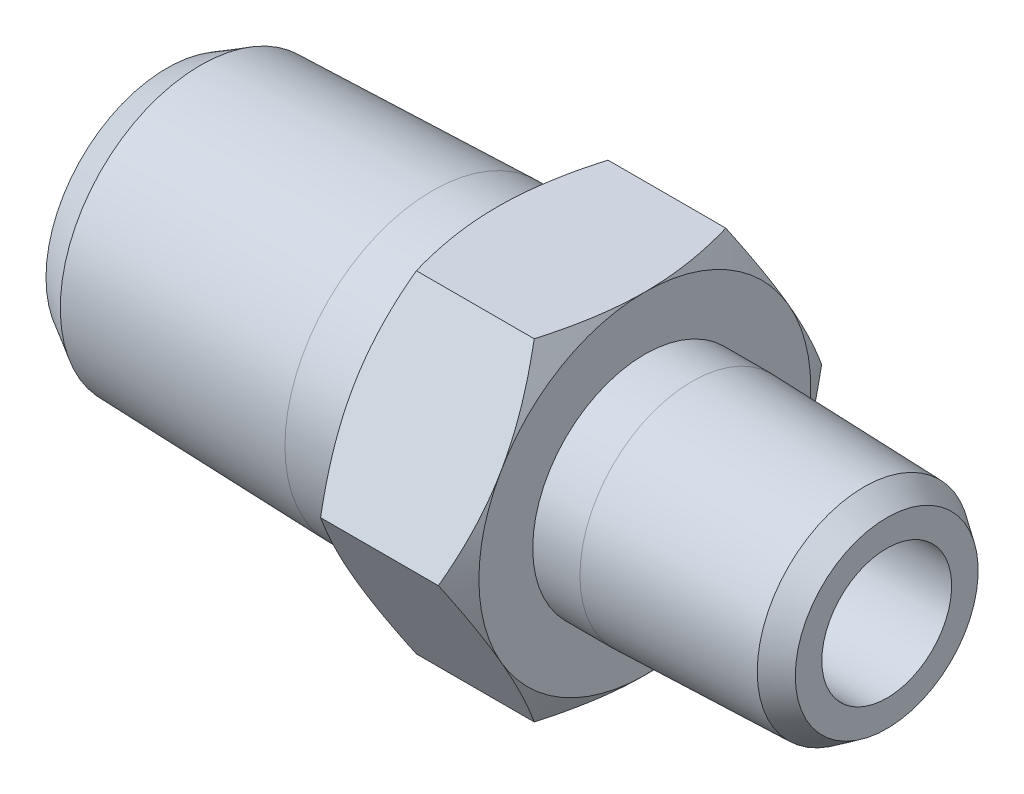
ISO-10303-21;
HEADER;
FILE_DESCRIPTION(('STEP AP214'),'2;1');
FILE_NAME('part.step','',(''),(''),'','','');
FILE_SCHEMA(('AUTOMOTIVE_DESIGN { 1 0 10303 214 1 1 1 1 }'));
ENDSEC;
DATA;
#1=APPLICATION_CONTEXT('core data for automotive mechanical design processes');
#2=APPLICATION_PROTOCOL_DEFINITION('international standard','automotive_design',2000,#1);
#3=PRODUCT_CONTEXT('',#1,'mechanical');
#4=PRODUCT('Part','Part','',(#3));
#5=PRODUCT_RELATED_PRODUCT_CATEGORY('part','',(#4));
#6=PRODUCT_DEFINITION_FORMATION('','',#4);
#7=PRODUCT_DEFINITION_CONTEXT('part definition',#1,'design');
#8=PRODUCT_DEFINITION('design','',#6,#7);
#9=PRODUCT_DEFINITION_SHAPE('','',#8);
#10=(LENGTH_UNIT() NAMED_UNIT(*) SI_UNIT(.MILLI.,.METRE.));
#11=(NAMED_UNIT(*) PLANE_ANGLE_UNIT() SI_UNIT($,.RADIAN.));
#12=(NAMED_UNIT(*) SI_UNIT($,.STERADIAN.) SOLID_ANGLE_UNIT());
#13=UNCERTAINTY_MEASURE_WITH_UNIT(LENGTH_MEASURE(1.E-05),#10,'distance_accuracy_value','');
#14=(GEOMETRIC_REPRESENTATION_CONTEXT(3) GLOBAL_UNCERTAINTY_ASSIGNED_CONTEXT((#13)) GLOBAL_UNIT_ASSIGNED_CONTEXT((#10,
#11,#12)) REPRESENTATION_CONTEXT('',''));
#15=CARTESIAN_POINT('',(0.,0.,0.));
#16=DIRECTION('',(0.,0.,1.));
#17=DIRECTION('',(1.,0.,0.));
#18=AXIS2_PLACEMENT_3D('',#15,#16,#17);
#19=CARTESIAN_POINT('',(8.38200000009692,0.,0.));
#20=DIRECTION('',(-1.,0.,0.));
#21=DIRECTION('',(0.,0.,1.));
#22=AXIS2_PLACEMENT_3D('',#19,#20,#21);
#23=CONICAL_SURFACE('',#22,4.82599999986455,0.0311192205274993);
#24=CARTESIAN_POINT('',(8.382,0.,0.));
#25=DIRECTION('',(1.,0.,0.));
#26=DIRECTION('',(0.,1.,0.));
#27=AXIS2_PLACEMENT_3D('',#24,#25,#26);
#28=CIRCLE('',#27,4.826);
#29=CARTESIAN_POINT('',(8.382,4.826,0.));
#30=VERTEX_POINT('',#29);
#31=EDGE_CURVE('E398',#30,#30,#28,.F.);
#32=ORIENTED_EDGE('',*,*,#31,.F.);
#33=EDGE_LOOP('',(#32));
#34=FACE_BOUND('',#33,.T.);
#35=CARTESIAN_POINT('',(15.7849748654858,0.,0.));
#36=DIRECTION('',(1.,0.,0.));
#37=DIRECTION('',(0.,0.,-1.));
#38=AXIS2_PLACEMENT_3D('',#35,#36,#37);
#39=CIRCLE('',#38,4.59555079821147);
#40=CARTESIAN_POINT('',(15.7849748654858,0.,-4.59555079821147));
#41=VERTEX_POINT('',#40);
#42=EDGE_CURVE('E20',#41,#41,#39,.T.);
#43=ORIENTED_EDGE('',*,*,#42,.F.);
#44=EDGE_LOOP('',(#43));
#45=FACE_BOUND('',#44,.T.);
#46=ADVANCED_FACE('F16',(#34,#45),#23,.T.);
#47=CARTESIAN_POINT('',(15.7479999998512,0.,0.));
#48=DIRECTION('',(-1.,0.,0.));
#49=DIRECTION('',(0.,0.,1.));
#50=AXIS2_PLACEMENT_3D('',#47,#48,#49);
#51=CONICAL_SURFACE('',#50,4.62042230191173,0.59214018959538);
#52=CARTESIAN_POINT('',(16.7640000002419,0.,0.));
#53=DIRECTION('',(-1.,0.,0.));
#54=DIRECTION('',(0.,0.,1.));
#55=AXIS2_PLACEMENT_3D('',#52,#53,#54);
#56=CIRCLE('',#55,3.93700000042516);
#57=CARTESIAN_POINT('',(16.7640000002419,0.,3.93700000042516));
#58=VERTEX_POINT('',#57);
#59=EDGE_CURVE('E400',#58,#58,#56,.F.);
#60=ORIENTED_EDGE('',*,*,#59,.F.);
#61=EDGE_LOOP('',(#60));
#62=FACE_BOUND('',#61,.T.);
#63=ORIENTED_EDGE('',*,*,#42,.T.);
#64=EDGE_LOOP('',(#63));
#65=FACE_BOUND('',#64,.T.);
#66=ADVANCED_FACE('F18',(#62,#65),#51,.T.);
#67=CARTESIAN_POINT('',(7.366,0.,0.));
#68=DIRECTION('',(1.,0.,0.));
#69=DIRECTION('',(0.,1.,0.));
#70=AXIS2_PLACEMENT_3D('',#67,#68,#69);
#71=CYLINDRICAL_SURFACE('',#70,4.826);
#72=CARTESIAN_POINT('',(6.35,0.,0.));
#73=DIRECTION('',(1.,0.,0.));
#74=DIRECTION('',(0.,1.,0.));
#75=AXIS2_PLACEMENT_3D('',#72,#73,#74);
#76=CIRCLE('',#75,4.826);
#77=CARTESIAN_POINT('',(6.35,4.826,0.));
#78=VERTEX_POINT('',#77);
#79=EDGE_CURVE('E421',#78,#78,#76,.F.);
#80=ORIENTED_EDGE('',*,*,#79,.F.);
#81=EDGE_LOOP('',(#80));
#82=FACE_BOUND('',#81,.T.);
#83=ORIENTED_EDGE('',*,*,#31,.T.);
#84=EDGE_LOOP('',(#83));
#85=FACE_BOUND('',#84,.T.);
#86=ADVANCED_FACE('F483',(#82,#85),#71,.T.);
#87=CARTESIAN_POINT('',(16.764,2.29439748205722,0.));
#88=DIRECTION('',(1.,0.,0.));
#89=DIRECTION('',(0.,0.,-1.));
#90=AXIS2_PLACEMENT_3D('',#87,#88,#89);
#91=PLANE('',#90);
#92=CARTESIAN_POINT('',(16.764,0.,0.));
#93=DIRECTION('',(-1.,0.,0.));
#94=DIRECTION('',(0.,0.,1.));
#95=AXIS2_PLACEMENT_3D('',#92,#93,#94);
#96=CIRCLE('',#95,2.794);
#97=CARTESIAN_POINT('',(16.764,0.,2.794));
#98=VERTEX_POINT('',#97);
#99=EDGE_CURVE('E127',#98,#98,#96,.T.);
#100=ORIENTED_EDGE('',*,*,#99,.T.);
#101=EDGE_LOOP('',(#100));
#102=FACE_BOUND('',#101,.T.);
#103=ORIENTED_EDGE('',*,*,#59,.T.);
#104=EDGE_LOOP('',(#103));
#105=FACE_BOUND('',#104,.T.);
#106=ADVANCED_FACE('F428',(#102,#105),#91,.T.);
#107=CARTESIAN_POINT('',(6.35,0.,0.));
#108=DIRECTION('',(1.,0.,0.));
#109=DIRECTION('',(0.,0.,-1.));
#110=AXIS2_PLACEMENT_3D('',#107,#108,#109);
#111=PLANE('',#110);
#112=ORIENTED_EDGE('',*,*,#79,.T.);
#113=EDGE_LOOP('',(#112));
#114=FACE_BOUND('',#113,.T.);
#115=CARTESIAN_POINT('',(6.35000000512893,0.,0.));
#116=DIRECTION('',(-1.,0.,0.));
#117=DIRECTION('',(0.,0.,1.));
#118=AXIS2_PLACEMENT_3D('',#115,#116,#117);
#119=CIRCLE('',#118,7.14375000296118);
#120=CARTESIAN_POINT('',(6.35000000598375,-3.57187500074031,6.18666897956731));
#121=VERTEX_POINT('',#120);
#122=CARTESIAN_POINT('',(6.35000000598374,3.5718750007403,6.18666897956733));
#123=VERTEX_POINT('',#122);
#124=EDGE_CURVE('E413',#121,#123,#119,.T.);
#125=ORIENTED_EDGE('',*,*,#124,.F.);
#126=CARTESIAN_POINT('',(6.35000000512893,0.,0.));
#127=DIRECTION('',(-1.,0.,0.));
#128=DIRECTION('',(0.,0.,1.));
#129=AXIS2_PLACEMENT_3D('',#126,#127,#128);
#130=CIRCLE('',#129,7.14375000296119);
#131=CARTESIAN_POINT('',(6.35000000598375,-7.14375000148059,0.));
#132=VERTEX_POINT('',#131);
#133=EDGE_CURVE('E109',#132,#121,#130,.T.);
#134=ORIENTED_EDGE('',*,*,#133,.F.);
#135=CARTESIAN_POINT('',(6.35000000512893,0.,0.));
#136=DIRECTION('',(-1.,0.,0.));
#137=DIRECTION('',(0.,0.,1.));
#138=AXIS2_PLACEMENT_3D('',#135,#136,#137);
#139=CIRCLE('',#138,7.14375000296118);
#140=CARTESIAN_POINT('',(6.35000000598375,-3.5718750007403,-6.18666897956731));
#141=VERTEX_POINT('',#140);
#142=EDGE_CURVE('E106',#141,#132,#139,.T.);
#143=ORIENTED_EDGE('',*,*,#142,.F.);
#144=CARTESIAN_POINT('',(6.35000000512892,0.,0.));
#145=DIRECTION('',(-1.,0.,0.));
#146=DIRECTION('',(0.,0.,1.));
#147=AXIS2_PLACEMENT_3D('',#144,#145,#146);
#148=CIRCLE('',#147,7.1437500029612);
#149=CARTESIAN_POINT('',(6.35000000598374,3.57187500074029,-6.18666897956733));
#150=VERTEX_POINT('',#149);
#151=EDGE_CURVE('E103',#150,#141,#148,.T.);
#152=ORIENTED_EDGE('',*,*,#151,.F.);
#153=CARTESIAN_POINT('',(6.35000000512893,0.,0.));
#154=DIRECTION('',(-1.,0.,0.));
#155=DIRECTION('',(0.,0.,1.));
#156=AXIS2_PLACEMENT_3D('',#153,#154,#155);
#157=CIRCLE('',#156,7.14375000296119);
#158=CARTESIAN_POINT('',(6.35000000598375,7.14375000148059,0.));
#159=VERTEX_POINT('',#158);
#160=EDGE_CURVE('E126',#159,#150,#157,.T.);
#161=ORIENTED_EDGE('',*,*,#160,.F.);
#162=CARTESIAN_POINT('',(6.35000000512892,0.,0.));
#163=DIRECTION('',(-1.,0.,0.));
#164=DIRECTION('',(0.,0.,1.));
#165=AXIS2_PLACEMENT_3D('',#162,#163,#164);
#166=CIRCLE('',#165,7.1437500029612);
#167=EDGE_CURVE('E415',#123,#159,#166,.T.);
#168=ORIENTED_EDGE('',*,*,#167,.F.);
#169=EDGE_LOOP('',(#125,#134,#143,#152,#161,#168));
#170=FACE_BOUND('',#169,.T.);
#171=ADVANCED_FACE('F107',(#114,#170),#111,.T.);
#172=CARTESIAN_POINT('',(16.002,0.,0.));
#173=DIRECTION('',(-1.,0.,0.));
#174=DIRECTION('',(0.,0.,1.));
#175=AXIS2_PLACEMENT_3D('',#172,#173,#174);
#176=CYLINDRICAL_SURFACE('',#175,2.794);
#177=ORIENTED_EDGE('',*,*,#99,.F.);
#178=EDGE_LOOP('',(#177));
#179=FACE_BOUND('',#178,.T.);
#180=CARTESIAN_POINT('',(3.45243928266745,0.,0.));
#181=DIRECTION('',(-1.,0.,0.));
#182=DIRECTION('',(0.,0.,1.));
#183=AXIS2_PLACEMENT_3D('',#180,#181,#182);
#184=CIRCLE('',#183,2.794);
#185=CARTESIAN_POINT('',(3.45243928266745,0.,2.794));
#186=VERTEX_POINT('',#185);
#187=EDGE_CURVE('E115',#186,#186,#184,.T.);
#188=ORIENTED_EDGE('',*,*,#187,.T.);
#189=EDGE_LOOP('',(#188));
#190=FACE_BOUND('',#189,.T.);
#191=ADVANCED_FACE('F160',(#179,#190),#176,.F.);
#192=CARTESIAN_POINT('',(5.7081176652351,0.,0.));
#193=DIRECTION('',(-1.,0.,0.));
#194=DIRECTION('',(0.,0.,1.));
#195=AXIS2_PLACEMENT_3D('',#192,#193,#194);
#196=CONICAL_SURFACE('',#195,8.25552282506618,1.04719755);
#197=ORIENTED_EDGE('',*,*,#151,.T.);
#198=CARTESIAN_POINT('',(5.71194598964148,1.49851707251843E-09,-8.24889197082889));
#199=CARTESIAN_POINT('',(5.80888667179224,-0.290749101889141,-8.08102789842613));
#200=CARTESIAN_POINT('',(5.89770126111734,-0.583826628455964,-7.91181950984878));
#201=CARTESIAN_POINT('',(6.05432419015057,-1.17256513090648,-7.57191117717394));
#202=CARTESIAN_POINT('',(6.12223640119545,-1.46820557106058,-7.40122308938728));
#203=CARTESIAN_POINT('',(6.20562106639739,-1.91445635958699,-7.14358007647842));
#204=CARTESIAN_POINT('',(6.23034546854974,-2.06377033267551,-7.05737361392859));
#205=CARTESIAN_POINT('',(6.27314392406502,-2.36311310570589,-6.88454798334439));
#206=CARTESIAN_POINT('',(6.29121815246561,-2.51314188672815,-6.79792882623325));
#207=CARTESIAN_POINT('',(6.32039869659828,-2.81446921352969,-6.6239574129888));
#208=CARTESIAN_POINT('',(6.33146957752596,-2.96577035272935,-6.53660365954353));
#209=CARTESIAN_POINT('',(6.34628555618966,-3.26867019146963,-6.36172435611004));
#210=CARTESIAN_POINT('',(6.35002920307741,-3.42026894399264,-6.27419877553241));
#211=CARTESIAN_POINT('',(6.35000000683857,-3.57187499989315,-6.18666897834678));
#212=B_SPLINE_CURVE_WITH_KNOTS('',3,(#198,#199,#200,#201,#202,#203,#204,#205,#206,#207,#208,
#209,#210,#211),.UNSPECIFIED.,.F.,.F.,(4,2,2,2,2,2,4),(0.,1.04875487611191,2.09221068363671,
2.61462320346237,3.13702197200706,3.66204321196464,4.18716839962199),.UNSPECIFIED.);
#213=CARTESIAN_POINT('',(5.71194599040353,5.85629918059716E-10,-8.2488919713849));
#214=VERTEX_POINT('',#213);
#215=EDGE_CURVE('E121',#214,#141,#212,.T.);
#216=ORIENTED_EDGE('',*,*,#215,.F.);
#217=CARTESIAN_POINT('',(6.35000000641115,3.57187499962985,-6.18666897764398));
#218=CARTESIAN_POINT('',(6.35002920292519,3.42026894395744,-6.2741987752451));
#219=CARTESIAN_POINT('',(6.3462855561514,3.26867019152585,-6.36172435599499));
#220=CARTESIAN_POINT('',(6.33146957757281,2.96577035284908,-6.53660365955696));
#221=CARTESIAN_POINT('',(6.32039869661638,2.81446921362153,-6.62395741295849));
#222=CARTESIAN_POINT('',(6.29121815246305,2.51314188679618,-6.79792882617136));
#223=CARTESIAN_POINT('',(6.27314392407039,2.36311310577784,-6.88454798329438));
#224=CARTESIAN_POINT('',(6.23034546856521,2.06377033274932,-7.05737361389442));
#225=CARTESIAN_POINT('',(6.20562106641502,1.91445635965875,-7.1435800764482));
#226=CARTESIAN_POINT('',(6.12223640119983,1.46820557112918,-7.40122308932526));
#227=CARTESIAN_POINT('',(6.05432419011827,1.17256513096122,-7.57191117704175));
#228=CARTESIAN_POINT('',(5.89770126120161,0.583826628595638,-7.91181950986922));
#229=CARTESIAN_POINT('',(5.80888667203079,0.290749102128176,-8.08102789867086));
#230=CARTESIAN_POINT('',(5.71194599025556,-1.02951186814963E-09,-8.24889197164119));
#231=B_SPLINE_CURVE_WITH_KNOTS('',3,(#217,#218,#219,#220,#221,#222,#223,#224,#225,#226,#227,
#228,#229,#230),.UNSPECIFIED.,.F.,.F.,(4,2,2,2,2,2,4),(0.,0.525125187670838,1.05014642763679,
1.57254519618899,2.09495771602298,3.13841352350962,4.18716839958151),.UNSPECIFIED.);
#232=EDGE_CURVE('E124',#150,#214,#231,.T.);
#233=ORIENTED_EDGE('',*,*,#232,.F.);
#234=EDGE_LOOP('',(#197,#216,#233));
#235=FACE_BOUND('',#234,.T.);
#236=ADVANCED_FACE('F119',(#235),#196,.T.);
#237=CARTESIAN_POINT('',(5.7081176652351,0.,0.));
#238=DIRECTION('',(-1.,0.,0.));
#239=DIRECTION('',(0.,0.,1.));
#240=AXIS2_PLACEMENT_3D('',#237,#238,#239);
#241=CONICAL_SURFACE('',#240,8.25552282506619,1.04719755);
#242=ORIENTED_EDGE('',*,*,#160,.T.);
#243=CARTESIAN_POINT('',(5.71194598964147,7.14375000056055,-4.12444598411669));
#244=CARTESIAN_POINT('',(5.80888667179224,6.85300089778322,-4.29231005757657));
#245=CARTESIAN_POINT('',(5.89770126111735,6.5599233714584,-4.46151844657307));
#246=CARTESIAN_POINT('',(6.05432419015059,5.97118486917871,-4.80142677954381));
#247=CARTESIAN_POINT('',(6.12223640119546,5.67554442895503,-4.97211486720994));
#248=CARTESIAN_POINT('',(6.2056210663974,5.22929364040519,-5.22975788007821));
#249=CARTESIAN_POINT('',(6.23034546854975,5.07997966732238,-5.31596434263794));
#250=CARTESIAN_POINT('',(6.27314392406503,4.78063689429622,-5.48878997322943));
#251=CARTESIAN_POINT('',(6.29121815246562,4.63060811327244,-5.57540913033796));
#252=CARTESIAN_POINT('',(6.3203986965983,4.3292807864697,-5.74938054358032));
#253=CARTESIAN_POINT('',(6.33146957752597,4.17797964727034,-5.83673429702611));
#254=CARTESIAN_POINT('',(6.34628555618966,3.87507980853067,-6.01161360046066));
#255=CARTESIAN_POINT('',(6.35002920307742,3.72348105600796,-6.09913918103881));
#256=CARTESIAN_POINT('',(6.35000000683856,3.57187500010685,-6.18666897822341));
#257=B_SPLINE_CURVE_WITH_KNOTS('',3,(#243,#244,#245,#246,#247,#248,#249,#250,#251,#252,#253,
#254,#255,#256),.UNSPECIFIED.,.F.,.F.,(4,2,2,2,2,2,4),(0.,1.04875487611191,2.09221068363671,
2.61462320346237,3.13702197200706,3.66204321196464,4.187168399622),.UNSPECIFIED.);
#258=CARTESIAN_POINT('',(5.71194599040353,7.14375000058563,-4.12444598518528));
#259=VERTEX_POINT('',#258);
#260=EDGE_CURVE('E134',#259,#150,#257,.T.);
#261=ORIENTED_EDGE('',*,*,#260,.F.);
#262=CARTESIAN_POINT('',(6.35000000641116,7.14374999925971,0.));
#263=CARTESIAN_POINT('',(6.3500292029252,7.14374999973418,-0.175059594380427));
#264=CARTESIAN_POINT('',(6.34628555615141,7.14374999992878,-0.350110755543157));
#265=CARTESIAN_POINT('',(6.33146957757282,7.1437500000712,-0.699869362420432));
#266=CARTESIAN_POINT('',(6.32039869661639,7.14375000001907,-0.874576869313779));
#267=CARTESIAN_POINT('',(6.29121815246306,7.14374999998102,-1.22251969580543));
#268=CARTESIAN_POINT('',(6.2731439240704,7.14374999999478,-1.39575801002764));
#269=CARTESIAN_POINT('',(6.23034546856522,7.14375000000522,-1.74140927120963));
#270=CARTESIAN_POINT('',(6.20562106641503,7.1437500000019,-1.91382219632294));
#271=CARTESIAN_POINT('',(6.12223640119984,7.14374999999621,-2.42910822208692));
#272=CARTESIAN_POINT('',(6.05432419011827,7.1437499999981,-2.77048439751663));
#273=CARTESIAN_POINT('',(5.89770126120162,7.14375000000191,-3.45030106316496));
#274=CARTESIAN_POINT('',(5.80888667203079,7.14375000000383,-3.78871784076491));
#275=CARTESIAN_POINT('',(5.71194599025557,7.14375,-4.12444598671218));
#276=B_SPLINE_CURVE_WITH_KNOTS('',3,(#262,#263,#264,#265,#266,#267,#268,#269,#270,#271,#272,
#273,#274,#275),.UNSPECIFIED.,.F.,.F.,(4,2,2,2,2,2,4),(0.,0.525125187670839,1.05014642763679,
1.57254519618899,2.09495771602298,3.13841352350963,4.18716839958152),.UNSPECIFIED.);
#277=EDGE_CURVE('E394',#159,#259,#276,.T.);
#278=ORIENTED_EDGE('',*,*,#277,.F.);
#279=EDGE_LOOP('',(#242,#261,#278));
#280=FACE_BOUND('',#279,.T.);
#281=ADVANCED_FACE('F159',(#280),#241,.T.);
#282=CARTESIAN_POINT('',(5.70811766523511,0.,0.));
#283=DIRECTION('',(-1.,0.,0.));
#284=DIRECTION('',(0.,0.,1.));
#285=AXIS2_PLACEMENT_3D('',#282,#283,#284);
#286=CONICAL_SURFACE('',#285,8.25552282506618,1.04719755);
#287=CARTESIAN_POINT('',(6.35000000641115,3.57187499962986,6.18666897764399));
#288=CARTESIAN_POINT('',(6.35002920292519,3.72348105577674,6.09913918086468));
#289=CARTESIAN_POINT('',(6.3462855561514,3.87507980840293,6.01161360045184));
#290=CARTESIAN_POINT('',(6.33146957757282,4.17797964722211,5.83673429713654));
#291=CARTESIAN_POINT('',(6.32039869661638,4.32928078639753,5.74938054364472));
#292=CARTESIAN_POINT('',(6.29121815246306,4.63060811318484,5.57540913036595));
#293=CARTESIAN_POINT('',(6.27314392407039,4.78063689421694,5.48878997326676));
#294=CARTESIAN_POINT('',(6.23034546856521,5.07997966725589,5.3159643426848));
#295=CARTESIAN_POINT('',(6.20562106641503,5.22929364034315,5.22975788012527));
#296=CARTESIAN_POINT('',(6.12223640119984,5.67554442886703,4.97211486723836));
#297=CARTESIAN_POINT('',(6.05432419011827,5.97118486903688,4.80142677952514));
#298=CARTESIAN_POINT('',(5.89770126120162,6.55992337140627,4.46151844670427));
#299=CARTESIAN_POINT('',(5.80888667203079,6.85300089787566,4.29231005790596));
#300=CARTESIAN_POINT('',(5.71194599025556,7.14375000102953,4.12444598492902));
#301=B_SPLINE_CURVE_WITH_KNOTS('',3,(#287,#288,#289,#290,#291,#292,#293,#294,#295,#296,#297,
#298,#299,#300),.UNSPECIFIED.,.F.,.F.,(4,2,2,2,2,2,4),(0.,0.52512518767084,1.05014642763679,
1.57254519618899,2.09495771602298,3.13841352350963,4.18716839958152),.UNSPECIFIED.);
#302=CARTESIAN_POINT('',(5.71194599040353,7.14375,4.12444598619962));
#303=VERTEX_POINT('',#302);
#304=EDGE_CURVE('E391',#123,#303,#301,.T.);
#305=ORIENTED_EDGE('',*,*,#304,.F.);
#306=ORIENTED_EDGE('',*,*,#167,.T.);
#307=CARTESIAN_POINT('',(5.71194598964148,7.14374999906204,4.1244459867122));
#308=CARTESIAN_POINT('',(5.80888667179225,7.14374999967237,3.78871784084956));
#309=CARTESIAN_POINT('',(5.89770126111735,7.14374999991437,3.45030106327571));
#310=CARTESIAN_POINT('',(6.05432419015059,7.1437500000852,2.77048439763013));
#311=CARTESIAN_POINT('',(6.12223640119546,7.14375000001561,2.42910822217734));
#312=CARTESIAN_POINT('',(6.2056210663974,7.14374999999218,1.9138221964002));
#313=CARTESIAN_POINT('',(6.23034546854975,7.14374999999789,1.74140927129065));
#314=CARTESIAN_POINT('',(6.27314392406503,7.1437500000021,1.39575801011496));
#315=CARTESIAN_POINT('',(6.29121815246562,7.1437500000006,1.2225196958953));
#316=CARTESIAN_POINT('',(6.3203986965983,7.14374999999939,0.87457686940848));
#317=CARTESIAN_POINT('',(6.33146957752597,7.1437499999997,0.699869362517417));
#318=CARTESIAN_POINT('',(6.34628555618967,7.1437500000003,0.35011075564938));
#319=CARTESIAN_POINT('',(6.35002920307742,7.14375000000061,0.175059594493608));
#320=CARTESIAN_POINT('',(6.35000000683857,7.14375,1.23382417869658E-10));
#321=B_SPLINE_CURVE_WITH_KNOTS('',3,(#307,#308,#309,#310,#311,#312,#313,#314,#315,#316,#317,
#318,#319,#320),.UNSPECIFIED.,.F.,.F.,(4,2,2,2,2,2,4),(0.,1.04875487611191,2.09221068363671,
2.61462320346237,3.13702197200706,3.66204321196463,4.18716839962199),.UNSPECIFIED.);
#322=EDGE_CURVE('E170',#303,#159,#321,.T.);
#323=ORIENTED_EDGE('',*,*,#322,.F.);
#324=EDGE_LOOP('',(#305,#306,#323));
#325=FACE_BOUND('',#324,.T.);
#326=ADVANCED_FACE('F657',(#325),#286,.T.);
#327=CARTESIAN_POINT('',(5.7081176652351,0.,0.));
#328=DIRECTION('',(-1.,0.,0.));
#329=DIRECTION('',(0.,0.,1.));
#330=AXIS2_PLACEMENT_3D('',#327,#328,#329);
#331=CONICAL_SURFACE('',#330,8.25552282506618,1.04719755);
#332=CARTESIAN_POINT('',(6.35000000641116,-3.57187499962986,6.18666897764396));
#333=CARTESIAN_POINT('',(6.3500292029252,-3.42026894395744,6.27419877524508));
#334=CARTESIAN_POINT('',(6.3462855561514,-3.26867019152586,6.36172435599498));
#335=CARTESIAN_POINT('',(6.33146957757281,-2.96577035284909,6.53660365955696));
#336=CARTESIAN_POINT('',(6.32039869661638,-2.81446921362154,6.62395741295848));
#337=CARTESIAN_POINT('',(6.29121815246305,-2.51314188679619,6.79792882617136));
#338=CARTESIAN_POINT('',(6.27314392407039,-2.36311310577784,6.88454798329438));
#339=CARTESIAN_POINT('',(6.23034546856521,-2.06377033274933,7.05737361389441));
#340=CARTESIAN_POINT('',(6.20562106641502,-1.91445635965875,7.1435800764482));
#341=CARTESIAN_POINT('',(6.12223640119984,-1.46820557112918,7.40122308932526));
#342=CARTESIAN_POINT('',(6.05432419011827,-1.17256513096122,7.57191117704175));
#343=CARTESIAN_POINT('',(5.89770126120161,-0.583826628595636,7.91181950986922));
#344=CARTESIAN_POINT('',(5.80888667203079,-0.29074910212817,8.08102789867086));
#345=CARTESIAN_POINT('',(5.71194599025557,1.02952665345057E-09,8.24889197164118));
#346=B_SPLINE_CURVE_WITH_KNOTS('',3,(#332,#333,#334,#335,#336,#337,#338,#339,#340,#341,#342,
#343,#344,#345),.UNSPECIFIED.,.F.,.F.,(4,2,2,2,2,2,4),(0.,0.52512518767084,1.05014642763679,
1.572545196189,2.09495771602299,3.13841352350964,4.18716839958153),.UNSPECIFIED.);
#347=CARTESIAN_POINT('',(5.71194599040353,-5.85612789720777E-10,8.2488919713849));
#348=VERTEX_POINT('',#347);
#349=EDGE_CURVE('E271',#121,#348,#346,.T.);
#350=ORIENTED_EDGE('',*,*,#349,.F.);
#351=ORIENTED_EDGE('',*,*,#124,.T.);
#352=CARTESIAN_POINT('',(5.71194598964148,-1.49850166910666E-09,8.24889197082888));
#353=CARTESIAN_POINT('',(5.80888667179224,0.290749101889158,8.08102789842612));
#354=CARTESIAN_POINT('',(5.89770126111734,0.583826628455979,7.91181950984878));
#355=CARTESIAN_POINT('',(6.05432419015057,1.1725651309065,7.57191117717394));
#356=CARTESIAN_POINT('',(6.12223640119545,1.46820557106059,7.40122308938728));
#357=CARTESIAN_POINT('',(6.20562106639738,1.914456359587,7.14358007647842));
#358=CARTESIAN_POINT('',(6.23034546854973,2.06377033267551,7.05737361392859));
#359=CARTESIAN_POINT('',(6.27314392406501,2.36311310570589,6.88454798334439));
#360=CARTESIAN_POINT('',(6.29121815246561,2.51314188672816,6.79792882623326));
#361=CARTESIAN_POINT('',(6.32039869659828,2.8144692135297,6.62395741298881));
#362=CARTESIAN_POINT('',(6.33146957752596,2.96577035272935,6.53660365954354));
#363=CARTESIAN_POINT('',(6.34628555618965,3.26867019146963,6.36172435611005));
#364=CARTESIAN_POINT('',(6.3500292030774,3.42026894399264,6.27419877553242));
#365=CARTESIAN_POINT('',(6.35000000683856,3.57187499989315,6.18666897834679));
#366=B_SPLINE_CURVE_WITH_KNOTS('',3,(#352,#353,#354,#355,#356,#357,#358,#359,#360,#361,#362,
#363,#364,#365),.UNSPECIFIED.,.F.,.F.,(4,2,2,2,2,2,4),(0.,1.0487548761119,2.09221068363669,
2.61462320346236,3.13702197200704,3.66204321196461,4.18716839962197),.UNSPECIFIED.);
#367=EDGE_CURVE('E384',#348,#123,#366,.T.);
#368=ORIENTED_EDGE('',*,*,#367,.F.);
#369=EDGE_LOOP('',(#350,#351,#368));
#370=FACE_BOUND('',#369,.T.);
#371=ADVANCED_FACE('F260',(#370),#331,.T.);
#372=CARTESIAN_POINT('',(5.70811766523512,0.,0.));
#373=DIRECTION('',(-1.,0.,0.));
#374=DIRECTION('',(0.,0.,1.));
#375=AXIS2_PLACEMENT_3D('',#372,#373,#374);
#376=CONICAL_SURFACE('',#375,8.25552282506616,1.04719755);
#377=CARTESIAN_POINT('',(6.35000000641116,-7.1437499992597,0.));
#378=CARTESIAN_POINT('',(6.3500292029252,-7.14374999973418,0.175059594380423));
#379=CARTESIAN_POINT('',(6.34628555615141,-7.14374999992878,0.350110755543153));
#380=CARTESIAN_POINT('',(6.33146957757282,-7.1437500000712,0.699869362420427));
#381=CARTESIAN_POINT('',(6.32039869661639,-7.14375000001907,0.874576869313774));
#382=CARTESIAN_POINT('',(6.29121815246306,-7.14374999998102,1.22251969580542));
#383=CARTESIAN_POINT('',(6.2731439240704,-7.14374999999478,1.39575801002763));
#384=CARTESIAN_POINT('',(6.23034546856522,-7.14375000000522,1.74140927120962));
#385=CARTESIAN_POINT('',(6.20562106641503,-7.1437500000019,1.91382219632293));
#386=CARTESIAN_POINT('',(6.12223640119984,-7.14374999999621,2.42910822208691));
#387=CARTESIAN_POINT('',(6.05432419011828,-7.1437499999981,2.77048439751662));
#388=CARTESIAN_POINT('',(5.89770126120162,-7.14375000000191,3.45030106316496));
#389=CARTESIAN_POINT('',(5.8088866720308,-7.14375000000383,3.7887178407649));
#390=CARTESIAN_POINT('',(5.71194599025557,-7.14375,4.12444598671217));
#391=B_SPLINE_CURVE_WITH_KNOTS('',3,(#377,#378,#379,#380,#381,#382,#383,#384,#385,#386,#387,
#388,#389,#390),.UNSPECIFIED.,.F.,.F.,(4,2,2,2,2,2,4),(0.,0.525125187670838,1.05014642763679,
1.57254519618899,2.09495771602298,3.13841352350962,4.18716839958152),.UNSPECIFIED.);
#392=CARTESIAN_POINT('',(5.71194599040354,-7.14375000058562,4.12444598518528));
#393=VERTEX_POINT('',#392);
#394=EDGE_CURVE('E246',#132,#393,#391,.T.);
#395=ORIENTED_EDGE('',*,*,#394,.F.);
#396=ORIENTED_EDGE('',*,*,#133,.T.);
#397=CARTESIAN_POINT('',(5.71194598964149,-7.14375000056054,4.12444598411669));
#398=CARTESIAN_POINT('',(5.80888667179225,-6.85300089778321,4.29231005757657));
#399=CARTESIAN_POINT('',(5.89770126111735,-6.55992337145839,4.46151844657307));
#400=CARTESIAN_POINT('',(6.05432419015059,-5.97118486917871,4.80142677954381));
#401=CARTESIAN_POINT('',(6.12223640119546,-5.67554442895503,4.97211486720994));
#402=CARTESIAN_POINT('',(6.2056210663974,-5.22929364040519,5.22975788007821));
#403=CARTESIAN_POINT('',(6.23034546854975,-5.07997966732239,5.31596434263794));
#404=CARTESIAN_POINT('',(6.27314392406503,-4.78063689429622,5.48878997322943));
#405=CARTESIAN_POINT('',(6.29121815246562,-4.63060811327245,5.57540913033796));
#406=CARTESIAN_POINT('',(6.3203986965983,-4.3292807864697,5.74938054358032));
#407=CARTESIAN_POINT('',(6.33146957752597,-4.17797964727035,5.83673429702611));
#408=CARTESIAN_POINT('',(6.34628555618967,-3.87507980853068,6.01161360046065));
#409=CARTESIAN_POINT('',(6.35002920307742,-3.72348105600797,6.0991391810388));
#410=CARTESIAN_POINT('',(6.35000000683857,-3.57187500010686,6.18666897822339));
#411=B_SPLINE_CURVE_WITH_KNOTS('',3,(#397,#398,#399,#400,#401,#402,#403,#404,#405,#406,#407,
#408,#409,#410),.UNSPECIFIED.,.F.,.F.,(4,2,2,2,2,2,4),(0.,1.0487548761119,2.09221068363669,
2.61462320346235,3.13702197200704,3.66204321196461,4.18716839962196),.UNSPECIFIED.);
#412=EDGE_CURVE('E264',#393,#121,#411,.T.);
#413=ORIENTED_EDGE('',*,*,#412,.F.);
#414=EDGE_LOOP('',(#395,#396,#413));
#415=FACE_BOUND('',#414,.T.);
#416=ADVANCED_FACE('F255',(#415),#376,.T.);
#417=CARTESIAN_POINT('',(5.70811766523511,0.,0.));
#418=DIRECTION('',(-1.,0.,0.));
#419=DIRECTION('',(0.,0.,1.));
#420=AXIS2_PLACEMENT_3D('',#417,#418,#419);
#421=CONICAL_SURFACE('',#420,8.25552282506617,1.04719755);
#422=ORIENTED_EDGE('',*,*,#142,.T.);
#423=CARTESIAN_POINT('',(5.71194598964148,-7.14374999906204,-4.12444598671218));
#424=CARTESIAN_POINT('',(5.80888667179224,-7.14374999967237,-3.78871784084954));
#425=CARTESIAN_POINT('',(5.89770126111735,-7.14374999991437,-3.45030106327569));
#426=CARTESIAN_POINT('',(6.05432419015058,-7.1437500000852,-2.77048439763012));
#427=CARTESIAN_POINT('',(6.12223640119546,-7.14375000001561,-2.42910822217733));
#428=CARTESIAN_POINT('',(6.20562106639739,-7.14374999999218,-1.9138221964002));
#429=CARTESIAN_POINT('',(6.23034546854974,-7.14374999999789,-1.74140927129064));
#430=CARTESIAN_POINT('',(6.27314392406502,-7.1437500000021,-1.39575801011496));
#431=CARTESIAN_POINT('',(6.29121815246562,-7.1437500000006,-1.22251969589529));
#432=CARTESIAN_POINT('',(6.32039869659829,-7.14374999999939,-0.874576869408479));
#433=CARTESIAN_POINT('',(6.33146957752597,-7.1437499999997,-0.699869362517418));
#434=CARTESIAN_POINT('',(6.34628555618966,-7.1437500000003,-0.350110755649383));
#435=CARTESIAN_POINT('',(6.35002920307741,-7.14375000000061,-0.175059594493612));
#436=CARTESIAN_POINT('',(6.35000000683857,-7.14375,-1.23387831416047E-10));
#437=B_SPLINE_CURVE_WITH_KNOTS('',3,(#423,#424,#425,#426,#427,#428,#429,#430,#431,#432,#433,
#434,#435,#436),.UNSPECIFIED.,.F.,.F.,(4,2,2,2,2,2,4),(0.,1.04875487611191,2.0922106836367,
2.61462320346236,3.13702197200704,3.66204321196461,4.18716839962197),.UNSPECIFIED.);
#438=CARTESIAN_POINT('',(5.71194599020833,-7.14375000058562,-4.1244459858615));
#439=VERTEX_POINT('',#438);
#440=EDGE_CURVE('E131',#439,#132,#437,.T.);
#441=ORIENTED_EDGE('',*,*,#440,.F.);
#442=CARTESIAN_POINT('',(6.35000000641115,-3.57187499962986,-6.18666897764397));
#443=CARTESIAN_POINT('',(6.35002920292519,-3.72348105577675,-6.09913918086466));
#444=CARTESIAN_POINT('',(6.3462855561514,-3.87507980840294,-6.01161360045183));
#445=CARTESIAN_POINT('',(6.33146957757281,-4.17797964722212,-5.83673429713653));
#446=CARTESIAN_POINT('',(6.32039869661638,-4.32928078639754,-5.74938054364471));
#447=CARTESIAN_POINT('',(6.29121815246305,-4.63060811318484,-5.57540913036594));
#448=CARTESIAN_POINT('',(6.27314392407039,-4.78063689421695,-5.48878997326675));
#449=CARTESIAN_POINT('',(6.23034546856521,-5.0799796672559,-5.31596434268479));
#450=CARTESIAN_POINT('',(6.20562106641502,-5.22929364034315,-5.22975788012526));
#451=CARTESIAN_POINT('',(6.12223640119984,-5.67554442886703,-4.97211486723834));
#452=CARTESIAN_POINT('',(6.05432419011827,-5.97118486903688,-4.80142677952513));
#453=CARTESIAN_POINT('',(5.89770126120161,-6.55992337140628,-4.46151844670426));
#454=CARTESIAN_POINT('',(5.80888667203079,-6.85300089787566,-4.29231005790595));
#455=CARTESIAN_POINT('',(5.71194599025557,-7.14375000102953,-4.124445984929));
#456=B_SPLINE_CURVE_WITH_KNOTS('',3,(#442,#443,#444,#445,#446,#447,#448,#449,#450,#451,#452,
#453,#454,#455),.UNSPECIFIED.,.F.,.F.,(4,2,2,2,2,2,4),(0.,0.525125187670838,1.05014642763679,
1.57254519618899,2.09495771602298,3.13841352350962,4.18716839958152),.UNSPECIFIED.);
#457=EDGE_CURVE('E129',#141,#439,#456,.T.);
#458=ORIENTED_EDGE('',*,*,#457,.F.);
#459=EDGE_LOOP('',(#422,#441,#458));
#460=FACE_BOUND('',#459,.T.);
#461=ADVANCED_FACE('F130',(#460),#421,.T.);
#462=CARTESIAN_POINT('',(3.048,0.,0.));
#463=DIRECTION('',(-1.,0.,0.));
#464=DIRECTION('',(0.,0.,1.));
#465=AXIS2_PLACEMENT_3D('',#462,#463,#464);
#466=CONICAL_SURFACE('',#465,3.4671,1.02974425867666);
#467=CARTESIAN_POINT('',(3.048,0.,0.));
#468=DIRECTION('',(-1.,0.,0.));
#469=DIRECTION('',(0.,0.,1.));
#470=AXIS2_PLACEMENT_3D('',#467,#468,#469);
#471=CIRCLE('',#470,3.4671);
#472=CARTESIAN_POINT('',(3.048,0.,3.4671));
#473=VERTEX_POINT('',#472);
#474=EDGE_CURVE('E240',#473,#473,#471,.T.);
#475=ORIENTED_EDGE('',*,*,#474,.T.);
#476=EDGE_LOOP('',(#475));
#477=FACE_BOUND('',#476,.T.);
#478=ORIENTED_EDGE('',*,*,#187,.F.);
#479=EDGE_LOOP('',(#478));
#480=FACE_BOUND('',#479,.T.);
#481=ADVANCED_FACE('F254',(#477,#480),#466,.F.);
#482=CARTESIAN_POINT('',(0.,0.,-8.24889197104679));
#483=DIRECTION('',(0.,-0.5,-0.866025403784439));
#484=DIRECTION('',(0.,0.866025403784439,-0.5));
#485=AXIS2_PLACEMENT_3D('',#482,#483,#484);
#486=PLANE('',#485);
#487=CARTESIAN_POINT('',(0.638054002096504,-2.19142849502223E-08,-8.24889195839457));
#488=CARTESIAN_POINT('',(0.541113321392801,-0.290749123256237,-8.08102788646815));
#489=CARTESIAN_POINT('',(0.452298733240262,-0.583826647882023,-7.91181949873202));
#490=CARTESIAN_POINT('',(0.295675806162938,-1.17256514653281,-7.57191116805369));
#491=CARTESIAN_POINT('',(0.227763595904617,-1.4682055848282,-7.40122308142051));
#492=CARTESIAN_POINT('',(0.144378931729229,-1.91445637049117,-7.14358007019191));
#493=CARTESIAN_POINT('',(0.119654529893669,-2.06377034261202,-7.05737360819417));
#494=CARTESIAN_POINT('',(0.0768560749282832,-2.36311311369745,-6.88454797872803));
#495=CARTESIAN_POINT('',(0.0587818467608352,-2.51314189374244,-6.79792882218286));
#496=CARTESIAN_POINT('',(0.0296013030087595,-2.81446921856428,-6.62395741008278));
#497=CARTESIAN_POINT('',(0.0185304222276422,-2.96577035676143,-6.53660365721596));
#498=CARTESIAN_POINT('',(0.00371444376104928,-3.26867019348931,-6.36172435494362));
#499=CARTESIAN_POINT('',(-2.92030762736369E-05,-3.42026894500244,-6.27419877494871));
#500=CARTESIAN_POINT('',(-6.83855786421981E-09,-3.57187499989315,-6.18666897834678));
#501=B_SPLINE_CURVE_WITH_KNOTS('',3,(#487,#488,#489,#490,#491,#492,#493,#494,#495,#496,#497,
#498,#499,#500),.UNSPECIFIED.,.F.,.F.,(4,2,2,2,2,2,4),(0.,1.0487548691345,2.09221066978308,
2.61462318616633,3.13702195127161,3.66204318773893,4.18716837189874),.UNSPECIFIED.);
#502=CARTESIAN_POINT('',(0.638054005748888,-1.09571363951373E-08,-8.24889196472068));
#503=VERTEX_POINT('',#502);
#504=CARTESIAN_POINT('',(-5.98373919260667E-09,-3.57187500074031,-6.18666897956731));
#505=VERTEX_POINT('',#504);
#506=EDGE_CURVE('E206',#503,#505,#501,.T.);
#507=ORIENTED_EDGE('',*,*,#506,.F.);
#508=DIRECTION('',(1.,0.,0.));
#509=VECTOR('',#508,1.);
#510=CARTESIAN_POINT('',(0.,0.,-8.24889197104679));
#511=LINE('',#510,#509);
#512=EDGE_CURVE('E138',#214,#503,#511,.F.);
#513=ORIENTED_EDGE('',*,*,#512,.F.);
#514=ORIENTED_EDGE('',*,*,#215,.T.);
#515=ORIENTED_EDGE('',*,*,#457,.T.);
#516=DIRECTION('',(1.,0.,0.));
#517=VECTOR('',#516,1.);
#518=CARTESIAN_POINT('',(0.,-7.14375,-4.12444598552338));
#519=LINE('',#518,#517);
#520=CARTESIAN_POINT('',(0.638054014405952,-7.14375,-4.12444600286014));
#521=VERTEX_POINT('',#520);
#522=EDGE_CURVE('E245',#521,#439,#519,.T.);
#523=ORIENTED_EDGE('',*,*,#522,.F.);
#524=CARTESIAN_POINT('',(-6.41114561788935E-09,-3.57187499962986,-6.18666897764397));
#525=CARTESIAN_POINT('',(-2.92029227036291E-05,-3.72348105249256,-6.0991391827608));
#526=CARTESIAN_POINT('',(0.00371444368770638,-3.87507980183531,-6.01161360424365));
#527=CARTESIAN_POINT('',(0.0185304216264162,-4.17797963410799,-5.83673430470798));
#528=CARTESIAN_POINT('',(0.0296013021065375,-4.32928077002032,-5.7493805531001));
#529=CARTESIAN_POINT('',(0.0587818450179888,-4.63060809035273,-5.57540914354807));
#530=CARTESIAN_POINT('',(0.0768560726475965,-4.78063686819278,-5.48878998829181));
#531=CARTESIAN_POINT('',(0.119654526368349,-5.07997963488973,-5.31596436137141));
#532=CARTESIAN_POINT('',(0.144378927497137,-5.22929360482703,-5.2297579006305));
#533=CARTESIAN_POINT('',(0.227763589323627,-5.67554438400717,-4.9721148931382));
#534=CARTESIAN_POINT('',(0.295675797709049,-5.97118481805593,-4.80142680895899));
#535=CARTESIAN_POINT('',(0.452298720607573,-6.55992330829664,-4.46151848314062));
#536=CARTESIAN_POINT('',(0.54111330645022,-6.85300082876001,-4.29231009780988));
#537=CARTESIAN_POINT('',(0.638053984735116,-7.14374992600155,-4.12444602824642));
#538=B_SPLINE_CURVE_WITH_KNOTS('',3,(#524,#525,#526,#527,#528,#529,#530,#531,#532,#533,#534,
#535,#536,#537),.UNSPECIFIED.,.F.,.F.,(4,2,2,2,2,2,4),(0.,0.525125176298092,1.05014640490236,
1.57254516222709,2.09495767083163,3.13841345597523,4.18716830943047),.UNSPECIFIED.);
#539=EDGE_CURVE('E234',#505,#521,#538,.T.);
#540=ORIENTED_EDGE('',*,*,#539,.F.);
#541=EDGE_LOOP('',(#507,#513,#514,#515,#523,#540));
#542=FACE_BOUND('',#541,.T.);
#543=ADVANCED_FACE('F137',(#542),#486,.T.);
#544=CARTESIAN_POINT('',(0.,7.14375,-4.12444598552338));
#545=DIRECTION('',(0.,0.5,-0.866025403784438));
#546=DIRECTION('',(0.,0.866025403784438,0.5));
#547=AXIS2_PLACEMENT_3D('',#544,#545,#546);
#548=PLANE('',#547);
#549=CARTESIAN_POINT('',(0.638054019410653,7.14375003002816,-4.12444596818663));
#550=CARTESIAN_POINT('',(0.541113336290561,6.85300092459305,-4.29231004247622));
#551=CARTESIAN_POINT('',(0.452298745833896,6.55992339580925,-4.46151843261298));
#552=CARTESIAN_POINT('',(0.295675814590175,5.97118488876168,-4.80142676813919));
#553=CARTESIAN_POINT('',(0.227763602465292,5.67554444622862,-4.97211485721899));
#554=CARTESIAN_POINT('',(0.144378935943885,5.22929365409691,-5.22975787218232));
#555=CARTESIAN_POINT('',(0.119654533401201,5.07997967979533,-5.31596433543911));
#556=CARTESIAN_POINT('',(0.0768560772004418,4.78063690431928,-5.48878996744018));
#557=CARTESIAN_POINT('',(0.058781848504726,4.6306081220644,-5.57540912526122));
#558=CARTESIAN_POINT('',(0.0296013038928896,4.32928079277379,-5.74938053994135));
#559=CARTESIAN_POINT('',(0.0185304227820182,4.17797965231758,-5.83673429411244));
#560=CARTESIAN_POINT('',(0.00371444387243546,3.8750798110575,-6.01161359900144));
#561=CARTESIAN_POINT('',(-2.92030779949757E-05,3.72348105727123,-6.09913918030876));
#562=CARTESIAN_POINT('',(-6.83855388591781E-09,3.57187500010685,-6.18666897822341));
#563=B_SPLINE_CURVE_WITH_KNOTS('',3,(#549,#550,#551,#552,#553,#554,#555,#556,#557,#558,#559,
#560,#561,#562),.UNSPECIFIED.,.F.,.F.,(4,2,2,2,2,2,4),(0.,1.04875488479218,2.09221070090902,
2.6146232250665,3.13702199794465,3.66204324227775,4.187168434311),.UNSPECIFIED.);
#564=CARTESIAN_POINT('',(0.638054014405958,7.14375001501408,-4.12444597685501));
#565=VERTEX_POINT('',#564);
#566=CARTESIAN_POINT('',(-5.98373942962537E-09,3.57187500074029,-6.18666897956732));
#567=VERTEX_POINT('',#566);
#568=EDGE_CURVE('E190',#565,#567,#563,.T.);
#569=ORIENTED_EDGE('',*,*,#568,.F.);
#570=DIRECTION('',(1.,0.,0.));
#571=VECTOR('',#570,1.);
#572=CARTESIAN_POINT('',(0.,7.14375,-4.12444598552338));
#573=LINE('',#572,#571);
#574=EDGE_CURVE('E392',#259,#565,#573,.F.);
#575=ORIENTED_EDGE('',*,*,#574,.F.);
#576=ORIENTED_EDGE('',*,*,#260,.T.);
#577=ORIENTED_EDGE('',*,*,#232,.T.);
#578=ORIENTED_EDGE('',*,*,#512,.T.);
#579=CARTESIAN_POINT('',(-6.41114445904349E-09,3.57187499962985,-6.18666897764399));
#580=CARTESIAN_POINT('',(-2.920292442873E-05,3.42026894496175,-6.27419877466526));
#581=CARTESIAN_POINT('',(0.0037144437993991,3.26867019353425,-6.36172435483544));
#582=CARTESIAN_POINT('',(0.0185304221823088,2.96577035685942,-6.53660365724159));
#583=CARTESIAN_POINT('',(0.0296013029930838,2.81446921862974,-6.623957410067));
#584=CARTESIAN_POINT('',(0.0587818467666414,2.51314189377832,-6.79792882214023));
#585=CARTESIAN_POINT('',(0.0768560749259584,2.36311311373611,-6.88454797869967));
#586=CARTESIAN_POINT('',(0.119654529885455,2.06377034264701,-7.05737360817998));
#587=CARTESIAN_POINT('',(0.144378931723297,1.9144563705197,-7.14358007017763));
#588=CARTESIAN_POINT('',(0.227763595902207,1.46820558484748,-7.401223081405));
#589=CARTESIAN_POINT('',(0.295675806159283,1.17256514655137,-7.57191116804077));
#590=CARTESIAN_POINT('',(0.452298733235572,0.583826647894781,-7.91181949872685));
#591=CARTESIAN_POINT('',(0.541113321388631,0.290749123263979,-8.0810278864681));
#592=CARTESIAN_POINT('',(0.638054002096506,2.19143027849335E-08,-8.24889195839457));
#593=B_SPLINE_CURVE_WITH_KNOTS('',3,(#579,#580,#581,#582,#583,#584,#585,#586,#587,#588,#589,
#590,#591,#592),.UNSPECIFIED.,.F.,.F.,(4,2,2,2,2,2,4),(0.,0.525125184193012,1.05014642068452,
1.57254518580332,2.0949577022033,3.13841350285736,4.18716837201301),.UNSPECIFIED.);
#594=EDGE_CURVE('E198',#567,#503,#593,.T.);
#595=ORIENTED_EDGE('',*,*,#594,.F.);
#596=EDGE_LOOP('',(#569,#575,#576,#577,#578,#595));
#597=FACE_BOUND('',#596,.T.);
#598=ADVANCED_FACE('F179',(#597),#548,.T.);
#599=CARTESIAN_POINT('',(0.,7.14375,4.12444598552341));
#600=DIRECTION('',(0.,1.,0.));
#601=DIRECTION('',(0.,0.,1.));
#602=AXIS2_PLACEMENT_3D('',#599,#600,#601);
#603=PLANE('',#602);
#604=CARTESIAN_POINT('',(0.63805398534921,7.14374999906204,4.12444590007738));
#605=CARTESIAN_POINT('',(0.541113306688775,7.14374999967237,3.78871776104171));
#606=CARTESIAN_POINT('',(0.452298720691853,7.14374999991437,3.450300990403));
#607=CARTESIAN_POINT('',(0.295675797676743,7.1437500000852,2.77048433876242));
#608=CARTESIAN_POINT('',(0.227763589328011,7.14375000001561,2.42910817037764));
#609=CARTESIAN_POINT('',(0.144378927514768,7.14374999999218,1.91382215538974));
#610=CARTESIAN_POINT('',(0.119654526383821,7.14374999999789,1.74140923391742));
#611=CARTESIAN_POINT('',(0.0768560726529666,7.1437500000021,1.39575798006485));
#612=CARTESIAN_POINT('',(0.0587818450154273,7.1437500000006,1.22251966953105));
#613=CARTESIAN_POINT('',(0.0296013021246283,7.14374999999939,0.874576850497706));
#614=CARTESIAN_POINT('',(0.0185304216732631,7.1437499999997,0.699869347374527));
#615=CARTESIAN_POINT('',(0.00371444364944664,7.1437500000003,0.350110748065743));
#616=CARTESIAN_POINT('',(-2.92030749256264E-05,7.14375000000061,0.17505959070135));
#617=CARTESIAN_POINT('',(-6.83856084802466E-09,7.14375,1.23382319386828E-10));
#618=B_SPLINE_CURVE_WITH_KNOTS('',3,(#604,#605,#606,#607,#608,#609,#610,#611,#612,#613,#614,
#615,#616,#617),.UNSPECIFIED.,.F.,.F.,(4,2,2,2,2,2,4),(0.,1.04875485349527,2.09221063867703,
2.61462314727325,3.13702190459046,3.66204313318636,4.18716830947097),.UNSPECIFIED.);
#619=CARTESIAN_POINT('',(0.638053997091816,7.14375,4.12444594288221));
#620=VERTEX_POINT('',#619);
#621=CARTESIAN_POINT('',(-5.98373780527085E-09,7.1437500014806,0.));
#622=VERTEX_POINT('',#621);
#623=EDGE_CURVE('E319',#620,#622,#618,.T.);
#624=ORIENTED_EDGE('',*,*,#623,.F.);
#625=DIRECTION('',(1.,0.,0.));
#626=VECTOR('',#625,1.);
#627=CARTESIAN_POINT('',(0.,7.14375,4.12444598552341));
#628=LINE('',#627,#626);
#629=EDGE_CURVE('E389',#303,#620,#628,.F.);
#630=ORIENTED_EDGE('',*,*,#629,.F.);
#631=ORIENTED_EDGE('',*,*,#322,.T.);
#632=ORIENTED_EDGE('',*,*,#277,.T.);
#633=ORIENTED_EDGE('',*,*,#574,.T.);
#634=CARTESIAN_POINT('',(-6.41115122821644E-09,7.14374999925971,0.));
#635=CARTESIAN_POINT('',(-2.92029227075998E-05,7.14374999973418,-0.175059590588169));
#636=CARTESIAN_POINT('',(0.00371444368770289,7.14374999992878,-0.350110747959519));
#637=CARTESIAN_POINT('',(0.0185304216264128,7.1437500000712,-0.699869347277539));
#638=CARTESIAN_POINT('',(0.0296013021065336,7.14375000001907,-0.874576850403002));
#639=CARTESIAN_POINT('',(0.0587818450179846,7.14374999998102,-1.22251966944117));
#640=CARTESIAN_POINT('',(0.0768560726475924,7.14374999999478,-1.39575797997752));
#641=CARTESIAN_POINT('',(0.119654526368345,7.14375000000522,-1.74140923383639));
#642=CARTESIAN_POINT('',(0.144378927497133,7.1437500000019,-1.91382215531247));
#643=CARTESIAN_POINT('',(0.227763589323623,7.14374999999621,-2.42910817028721));
#644=CARTESIAN_POINT('',(0.295675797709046,7.1437499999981,-2.7704843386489));
#645=CARTESIAN_POINT('',(0.452298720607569,7.14375000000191,-3.45030099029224));
#646=CARTESIAN_POINT('',(0.541113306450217,7.14375000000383,-3.78871776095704));
#647=CARTESIAN_POINT('',(0.638053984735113,7.14375,-4.12444590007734));
#648=B_SPLINE_CURVE_WITH_KNOTS('',3,(#634,#635,#636,#637,#638,#639,#640,#641,#642,#643,#644,
#645,#646,#647),.UNSPECIFIED.,.F.,.F.,(4,2,2,2,2,2,4),(0.,0.525125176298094,1.05014640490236,
1.57254516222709,2.09495767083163,3.13841345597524,4.18716830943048),.UNSPECIFIED.);
#649=EDGE_CURVE('E328',#622,#565,#648,.T.);
#650=ORIENTED_EDGE('',*,*,#649,.F.);
#651=EDGE_LOOP('',(#624,#630,#631,#632,#633,#650));
#652=FACE_BOUND('',#651,.T.);
#653=ADVANCED_FACE('F182',(#652),#603,.T.);
#654=CARTESIAN_POINT('',(0.,0.,8.24889197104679));
#655=DIRECTION('',(0.,0.5,0.866025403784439));
#656=DIRECTION('',(0.,-0.866025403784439,0.5));
#657=AXIS2_PLACEMENT_3D('',#654,#655,#656);
#658=PLANE('',#657);
#659=DIRECTION('',(1.,0.,0.));
#660=VECTOR('',#659,1.);
#661=CARTESIAN_POINT('',(0.,0.,8.24889197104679));
#662=LINE('',#661,#660);
#663=CARTESIAN_POINT('',(0.638053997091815,3.69283653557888E-08,8.24889194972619));
#664=VERTEX_POINT('',#663);
#665=EDGE_CURVE('E270',#348,#664,#662,.F.);
#666=ORIENTED_EDGE('',*,*,#665,.F.);
#667=ORIENTED_EDGE('',*,*,#367,.T.);
#668=ORIENTED_EDGE('',*,*,#304,.T.);
#669=ORIENTED_EDGE('',*,*,#629,.T.);
#670=CARTESIAN_POINT('',(-6.41114098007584E-09,3.57187499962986,6.18666897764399));
#671=CARTESIAN_POINT('',(-2.92029261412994E-05,3.72348105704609,6.09913918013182));
#672=CARTESIAN_POINT('',(0.00371444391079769,3.87507981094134,6.01161359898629));
#673=CARTESIAN_POINT('',(0.0185304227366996,4.17797965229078,5.83673429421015));
#674=CARTESIAN_POINT('',(0.0296013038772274,4.32928079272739,5.74938053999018));
#675=CARTESIAN_POINT('',(0.0587818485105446,4.63060812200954,5.57540912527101));
#676=CARTESIAN_POINT('',(0.0768560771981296,4.78063690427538,5.48878996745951));
#677=CARTESIAN_POINT('',(0.119654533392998,5.07997967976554,5.31596433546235));
#678=CARTESIAN_POINT('',(0.144378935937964,5.22929365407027,5.22975787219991));
#679=CARTESIAN_POINT('',(0.227763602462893,5.67554444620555,4.97211485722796));
#680=CARTESIAN_POINT('',(0.29567581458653,5.97118488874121,4.80142676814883));
#681=CARTESIAN_POINT('',(0.452298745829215,6.5599233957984,4.46151843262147));
#682=CARTESIAN_POINT('',(0.541113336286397,6.85300092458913,4.29231004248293));
#683=CARTESIAN_POINT('',(0.638054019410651,7.14375003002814,4.12444596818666));
#684=B_SPLINE_CURVE_WITH_KNOTS('',3,(#670,#671,#672,#673,#674,#675,#676,#677,#678,#679,#680,
#681,#682,#683),.UNSPECIFIED.,.F.,.F.,(4,2,2,2,2,2,4),(0.,0.525125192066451,1.05014643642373,
1.5725452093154,2.09495773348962,3.13841354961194,4.18716843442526),.UNSPECIFIED.);
#685=CARTESIAN_POINT('',(-5.98373600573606E-09,3.57187500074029,6.18666897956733));
#686=VERTEX_POINT('',#685);
#687=EDGE_CURVE('E315',#686,#620,#684,.T.);
#688=ORIENTED_EDGE('',*,*,#687,.F.);
#689=CARTESIAN_POINT('',(0.638053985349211,7.35294554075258E-08,8.24889192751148));
#690=CARTESIAN_POINT('',(0.541113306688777,0.290749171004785,8.0810278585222));
#691=CARTESIAN_POINT('',(0.452298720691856,0.58382669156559,7.91181947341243));
#692=CARTESIAN_POINT('',(0.295675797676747,1.17256518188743,7.57191114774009));
#693=CARTESIAN_POINT('',(0.227763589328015,1.46820561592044,7.40122306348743));
#694=CARTESIAN_POINT('',(0.144378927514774,1.9144563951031,7.14358005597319));
#695=CARTESIAN_POINT('',(0.119654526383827,2.06377036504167,7.05737359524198));
#696=CARTESIAN_POINT('',(0.0768560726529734,2.36311313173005,6.88454796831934));
#697=CARTESIAN_POINT('',(0.0587818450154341,2.51314190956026,6.79792881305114));
#698=CARTESIAN_POINT('',(0.0296013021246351,2.8144692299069,6.62395740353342));
#699=CARTESIAN_POINT('',(0.01853042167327,2.96577036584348,6.5366036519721));
#700=CARTESIAN_POINT('',(0.00371444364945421,3.26867019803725,6.36172435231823));
#701=CARTESIAN_POINT('',(-2.92030749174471E-05,3.42026894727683,6.2741987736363));
#702=CARTESIAN_POINT('',(-6.83855166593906E-09,3.57187499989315,6.18666897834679));
#703=B_SPLINE_CURVE_WITH_KNOTS('',3,(#689,#690,#691,#692,#693,#694,#695,#696,#697,#698,#699,
#700,#701,#702),.UNSPECIFIED.,.F.,.F.,(4,2,2,2,2,2,4),(0.,1.04875485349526,2.09221063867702,
2.61462314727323,3.13702190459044,3.66204313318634,4.18716830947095),.UNSPECIFIED.);
#704=EDGE_CURVE('E297',#664,#686,#703,.T.);
#705=ORIENTED_EDGE('',*,*,#704,.F.);
#706=EDGE_LOOP('',(#666,#667,#668,#669,#688,#705));
#707=FACE_BOUND('',#706,.T.);
#708=ADVANCED_FACE('F279',(#707),#658,.T.);
#709=CARTESIAN_POINT('',(0.,-7.14375,4.12444598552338));
#710=DIRECTION('',(0.,-0.5,0.866025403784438));
#711=DIRECTION('',(0.,-0.866025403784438,-0.5));
#712=AXIS2_PLACEMENT_3D('',#709,#710,#711);
#713=PLANE('',#712);
#714=DIRECTION('',(1.,0.,0.));
#715=VECTOR('',#714,1.);
#716=CARTESIAN_POINT('',(0.,-7.14375,4.12444598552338));
#717=LINE('',#716,#715);
#718=CARTESIAN_POINT('',(0.638053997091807,-7.14374996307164,4.12444600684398));
#719=VERTEX_POINT('',#718);
#720=EDGE_CURVE('E387',#393,#719,#717,.F.);
#721=ORIENTED_EDGE('',*,*,#720,.F.);
#722=ORIENTED_EDGE('',*,*,#412,.T.);
#723=ORIENTED_EDGE('',*,*,#349,.T.);
#724=ORIENTED_EDGE('',*,*,#665,.T.);
#725=CARTESIAN_POINT('',(-6.41115037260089E-09,-3.57187499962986,6.18666897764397));
#726=CARTESIAN_POINT('',(-2.9202926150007E-05,-3.42026894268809,6.27419877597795));
#727=CARTESIAN_POINT('',(0.00371444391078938,-3.26867018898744,6.36172435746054));
#728=CARTESIAN_POINT('',(0.0185304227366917,-2.96577034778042,6.53660366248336));
#729=CARTESIAN_POINT('',(0.0296013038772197,-2.81446920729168,6.62395741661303));
#730=CARTESIAN_POINT('',(0.0587818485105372,-2.51314187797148,6.79792883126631));
#731=CARTESIAN_POINT('',(0.0768560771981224,-2.36311309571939,6.88454798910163));
#732=CARTESIAN_POINT('',(0.119654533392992,-2.06377032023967,7.05737362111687));
#733=CARTESIAN_POINT('',(0.144378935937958,-1.91445634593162,7.14358008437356));
#734=CARTESIAN_POINT('',(0.227763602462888,-1.46820555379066,7.40122309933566));
#735=CARTESIAN_POINT('',(0.295675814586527,-1.17256511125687,7.57191118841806));
#736=CARTESIAN_POINT('',(0.452298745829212,-0.583826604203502,7.91181952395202));
#737=CARTESIAN_POINT('',(0.541113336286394,-0.290749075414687,8.08102791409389));
#738=CARTESIAN_POINT('',(0.638054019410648,3.00281465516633E-08,8.24889198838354));
#739=B_SPLINE_CURVE_WITH_KNOTS('',3,(#725,#726,#727,#728,#729,#730,#731,#732,#733,#734,#735,
#736,#737,#738),.UNSPECIFIED.,.F.,.F.,(4,2,2,2,2,2,4),(0.,0.525125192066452,1.05014643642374,
1.57254520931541,2.09495773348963,3.13841354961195,4.18716843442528),.UNSPECIFIED.);
#740=CARTESIAN_POINT('',(-5.98373799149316E-09,-3.5718750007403,6.18666897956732));
#741=VERTEX_POINT('',#740);
#742=EDGE_CURVE('E35',#741,#664,#739,.T.);
#743=ORIENTED_EDGE('',*,*,#742,.F.);
#744=CARTESIAN_POINT('',(0.638053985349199,-7.14374992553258,4.12444602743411));
#745=CARTESIAN_POINT('',(0.541113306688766,-6.85300082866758,4.2923100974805));
#746=CARTESIAN_POINT('',(0.452298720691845,-6.55992330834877,4.46151848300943));
#747=CARTESIAN_POINT('',(0.295675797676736,-5.97118481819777,4.80142680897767));
#748=CARTESIAN_POINT('',(0.227763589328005,-5.67554438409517,4.97211489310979));
#749=CARTESIAN_POINT('',(0.144378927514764,-5.22929360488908,5.22975790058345));
#750=CARTESIAN_POINT('',(0.119654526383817,-5.07997963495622,5.31596436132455));
#751=CARTESIAN_POINT('',(0.0768560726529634,-4.78063686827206,5.48878998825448));
#752=CARTESIAN_POINT('',(0.058781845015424,-4.63060809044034,5.57540914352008));
#753=CARTESIAN_POINT('',(0.0296013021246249,-4.32928077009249,5.7493805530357));
#754=CARTESIAN_POINT('',(0.0185304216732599,-4.17797963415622,5.83673430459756));
#755=CARTESIAN_POINT('',(0.00371444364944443,-3.87507980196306,6.01161360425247));
#756=CARTESIAN_POINT('',(-2.92030749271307E-05,-3.72348105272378,6.09913918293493));
#757=CARTESIAN_POINT('',(-6.8385615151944E-09,-3.57187500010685,6.18666897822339));
#758=B_SPLINE_CURVE_WITH_KNOTS('',3,(#744,#745,#746,#747,#748,#749,#750,#751,#752,#753,#754,
#755,#756,#757),.UNSPECIFIED.,.F.,.F.,(4,2,2,2,2,2,4),(0.,1.04875485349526,2.09221063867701,
2.61462314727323,3.13702190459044,3.66204313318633,4.18716830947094),.UNSPECIFIED.);
#759=EDGE_CURVE('E285',#719,#741,#758,.T.);
#760=ORIENTED_EDGE('',*,*,#759,.F.);
#761=EDGE_LOOP('',(#721,#722,#723,#724,#743,#760));
#762=FACE_BOUND('',#761,.T.);
#763=ADVANCED_FACE('F276',(#762),#713,.T.);
#764=CARTESIAN_POINT('',(0.,-7.14375,-4.12444598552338));
#765=DIRECTION('',(0.,-1.,0.));
#766=DIRECTION('',(0.,0.,-1.));
#767=AXIS2_PLACEMENT_3D('',#764,#765,#766);
#768=PLANE('',#767);
#769=ORIENTED_EDGE('',*,*,#522,.T.);
#770=ORIENTED_EDGE('',*,*,#440,.T.);
#771=ORIENTED_EDGE('',*,*,#394,.T.);
#772=ORIENTED_EDGE('',*,*,#720,.T.);
#773=CARTESIAN_POINT('',(-6.41115015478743E-09,-7.1437499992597,0.));
#774=CARTESIAN_POINT('',(-2.9202926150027E-05,-7.14374999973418,0.175059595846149));
#775=CARTESIAN_POINT('',(0.00371444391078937,-7.14374999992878,0.350110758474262));
#776=CARTESIAN_POINT('',(0.0185304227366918,-7.1437500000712,0.69986936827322));
#777=CARTESIAN_POINT('',(0.0296013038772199,-7.14375000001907,0.874576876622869));
#778=CARTESIAN_POINT('',(0.0587818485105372,-7.14374999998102,1.22251970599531));
#779=CARTESIAN_POINT('',(0.0768560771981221,-7.14374999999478,1.39575802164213));
#780=CARTESIAN_POINT('',(0.119654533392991,-7.14375000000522,1.74140928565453));
#781=CARTESIAN_POINT('',(0.144378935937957,-7.1437500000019,1.91382221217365));
#782=CARTESIAN_POINT('',(0.227763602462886,-7.14374999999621,2.42910824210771));
#783=CARTESIAN_POINT('',(0.295675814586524,-7.1437499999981,2.77048442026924));
#784=CARTESIAN_POINT('',(0.452298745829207,-7.14375000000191,3.45030109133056));
#785=CARTESIAN_POINT('',(0.541113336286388,-7.14375000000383,3.78871787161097));
#786=CARTESIAN_POINT('',(0.63805401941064,-7.14375,4.12444602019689));
#787=B_SPLINE_CURVE_WITH_KNOTS('',3,(#773,#774,#775,#776,#777,#778,#779,#780,#781,#782,#783,
#784,#785,#786),.UNSPECIFIED.,.F.,.F.,(4,2,2,2,2,2,4),(0.,0.525125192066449,1.05014643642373,
1.5725452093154,2.09495773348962,3.13841354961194,4.18716843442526),.UNSPECIFIED.);
#788=CARTESIAN_POINT('',(-5.98374278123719E-09,-7.14375000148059,0.));
#789=VERTEX_POINT('',#788);
#790=EDGE_CURVE('E357',#789,#719,#787,.T.);
#791=ORIENTED_EDGE('',*,*,#790,.F.);
#792=CARTESIAN_POINT('',(0.638054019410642,-7.14375,-4.12444602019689));
#793=CARTESIAN_POINT('',(0.541113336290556,-7.14375,-3.7887178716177));
#794=CARTESIAN_POINT('',(0.452298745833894,-7.14375,-3.45030109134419));
#795=CARTESIAN_POINT('',(0.295675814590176,-7.14375,-2.77048442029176));
#796=CARTESIAN_POINT('',(0.227763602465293,-7.14375,-2.42910824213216));
#797=CARTESIAN_POINT('',(0.144378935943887,-7.14375,-1.91382221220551));
#798=CARTESIAN_POINT('',(0.119654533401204,-7.14375,-1.74140928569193));
#799=CARTESIAN_POINT('',(0.0768560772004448,-7.14375,-1.3957580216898));
#800=CARTESIAN_POINT('',(0.0587818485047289,-7.14375,-1.22251970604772));
#801=CARTESIAN_POINT('',(0.0296013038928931,-7.14375,-0.874576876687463));
#802=CARTESIAN_POINT('',(0.0185304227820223,-7.14375,-0.69986936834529));
#803=CARTESIAN_POINT('',(0.00371444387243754,-7.14375,-0.350110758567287));
#804=CARTESIAN_POINT('',(-2.92030779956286E-05,-7.14375,-0.175059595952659));
#805=CARTESIAN_POINT('',(-6.83856104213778E-09,-7.14375,-1.23384046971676E-10));
#806=B_SPLINE_CURVE_WITH_KNOTS('',3,(#792,#793,#794,#795,#796,#797,#798,#799,#800,#801,#802,
#803,#804,#805),.UNSPECIFIED.,.F.,.F.,(4,2,2,2,2,2,4),(0.,1.04875488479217,2.092210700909,
2.61462322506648,3.13702199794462,3.66204324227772,4.18716843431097),.UNSPECIFIED.);
#807=EDGE_CURVE('E207',#521,#789,#806,.T.);
#808=ORIENTED_EDGE('',*,*,#807,.F.);
#809=EDGE_LOOP('',(#769,#770,#771,#772,#791,#808));
#810=FACE_BOUND('',#809,.T.);
#811=ADVANCED_FACE('F230',(#810),#768,.T.);
#812=CARTESIAN_POINT('',(-14.224,0.,0.));
#813=DIRECTION('',(1.,0.,0.));
#814=DIRECTION('',(0.,0.,-1.));
#815=AXIS2_PLACEMENT_3D('',#812,#813,#814);
#816=CYLINDRICAL_SURFACE('',#815,3.4671);
#817=CARTESIAN_POINT('',(-14.224,0.,0.));
#818=DIRECTION('',(1.,0.,0.));
#819=DIRECTION('',(0.,0.,-1.));
#820=AXIS2_PLACEMENT_3D('',#817,#818,#819);
#821=CIRCLE('',#820,3.4671);
#822=CARTESIAN_POINT('',(-14.224,0.,-3.4671));
#823=VERTEX_POINT('',#822);
#824=EDGE_CURVE('E352',#823,#823,#821,.T.);
#825=ORIENTED_EDGE('',*,*,#824,.F.);
#826=EDGE_LOOP('',(#825));
#827=FACE_BOUND('',#826,.T.);
#828=ORIENTED_EDGE('',*,*,#474,.F.);
#829=EDGE_LOOP('',(#828));
#830=FACE_BOUND('',#829,.T.);
#831=ADVANCED_FACE('F228',(#827,#830),#816,.F.);
#832=CARTESIAN_POINT('',(0.641882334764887,0.,0.));
#833=DIRECTION('',(1.,0.,0.));
#834=DIRECTION('',(0.,0.,-1.));
#835=AXIS2_PLACEMENT_3D('',#832,#833,#834);
#836=CONICAL_SURFACE('',#835,8.25552282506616,1.04719755);
#837=ORIENTED_EDGE('',*,*,#807,.T.);
#838=CARTESIAN_POINT('',(-5.12892050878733E-09,0.,0.));
#839=DIRECTION('',(1.,0.,0.));
#840=DIRECTION('',(0.,0.,-1.));
#841=AXIS2_PLACEMENT_3D('',#838,#839,#840);
#842=CIRCLE('',#841,7.14375000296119);
#843=EDGE_CURVE('E347',#789,#505,#842,.T.);
#844=ORIENTED_EDGE('',*,*,#843,.T.);
#845=ORIENTED_EDGE('',*,*,#539,.T.);
#846=EDGE_LOOP('',(#837,#844,#845));
#847=FACE_BOUND('',#846,.T.);
#848=ADVANCED_FACE('F221',(#847),#836,.T.);
#849=CARTESIAN_POINT('',(0.6418823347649,0.,0.));
#850=DIRECTION('',(1.,0.,0.));
#851=DIRECTION('',(0.,0.,-1.));
#852=AXIS2_PLACEMENT_3D('',#849,#850,#851);
#853=CONICAL_SURFACE('',#852,8.25552282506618,1.04719755);
#854=ORIENTED_EDGE('',*,*,#506,.T.);
#855=CARTESIAN_POINT('',(-5.12892452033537E-09,0.,0.));
#856=DIRECTION('',(1.,0.,0.));
#857=DIRECTION('',(0.,0.,-1.));
#858=AXIS2_PLACEMENT_3D('',#855,#856,#857);
#859=CIRCLE('',#858,7.14375000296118);
#860=EDGE_CURVE('E340',#505,#567,#859,.T.);
#861=ORIENTED_EDGE('',*,*,#860,.T.);
#862=ORIENTED_EDGE('',*,*,#594,.T.);
#863=EDGE_LOOP('',(#854,#861,#862));
#864=FACE_BOUND('',#863,.T.);
#865=ADVANCED_FACE('F217',(#864),#853,.T.);
#866=CARTESIAN_POINT('',(0.641882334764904,0.,0.));
#867=DIRECTION('',(1.,0.,0.));
#868=DIRECTION('',(0.,0.,-1.));
#869=AXIS2_PLACEMENT_3D('',#866,#867,#868);
#870=CONICAL_SURFACE('',#869,8.25552282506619,1.04719755);
#871=ORIENTED_EDGE('',*,*,#568,.T.);
#872=CARTESIAN_POINT('',(-5.12891476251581E-09,0.,0.));
#873=DIRECTION('',(1.,0.,0.));
#874=DIRECTION('',(0.,0.,-1.));
#875=AXIS2_PLACEMENT_3D('',#872,#873,#874);
#876=CIRCLE('',#875,7.1437500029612);
#877=EDGE_CURVE('E348',#567,#622,#876,.T.);
#878=ORIENTED_EDGE('',*,*,#877,.T.);
#879=ORIENTED_EDGE('',*,*,#649,.T.);
#880=EDGE_LOOP('',(#871,#878,#879));
#881=FACE_BOUND('',#880,.T.);
#882=ADVANCED_FACE('F220',(#881),#870,.T.);
#883=CARTESIAN_POINT('',(0.6418823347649,0.,0.));
#884=DIRECTION('',(1.,0.,0.));
#885=DIRECTION('',(0.,0.,-1.));
#886=AXIS2_PLACEMENT_3D('',#883,#884,#885);
#887=CONICAL_SURFACE('',#886,8.25552282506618,1.04719755);
#888=CARTESIAN_POINT('',(-5.12892040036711E-09,0.,0.));
#889=DIRECTION('',(1.,0.,0.));
#890=DIRECTION('',(0.,0.,-1.));
#891=AXIS2_PLACEMENT_3D('',#888,#889,#890);
#892=CIRCLE('',#891,7.14375000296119);
#893=EDGE_CURVE('E350',#622,#686,#892,.T.);
#894=ORIENTED_EDGE('',*,*,#893,.T.);
#895=ORIENTED_EDGE('',*,*,#687,.T.);
#896=ORIENTED_EDGE('',*,*,#623,.T.);
#897=EDGE_LOOP('',(#894,#895,#896));
#898=FACE_BOUND('',#897,.T.);
#899=ADVANCED_FACE('F306',(#898),#887,.T.);
#900=CARTESIAN_POINT('',(0.6418823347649,0.,0.));
#901=DIRECTION('',(1.,0.,0.));
#902=DIRECTION('',(0.,0.,-1.));
#903=AXIS2_PLACEMENT_3D('',#900,#901,#902);
#904=CONICAL_SURFACE('',#903,8.25552282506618,1.04719755);
#905=CARTESIAN_POINT('',(-5.12891497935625E-09,0.,0.));
#906=DIRECTION('',(1.,0.,0.));
#907=DIRECTION('',(0.,0.,-1.));
#908=AXIS2_PLACEMENT_3D('',#905,#906,#907);
#909=CIRCLE('',#908,7.1437500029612);
#910=EDGE_CURVE('E368',#686,#741,#909,.T.);
#911=ORIENTED_EDGE('',*,*,#910,.T.);
#912=ORIENTED_EDGE('',*,*,#742,.T.);
#913=ORIENTED_EDGE('',*,*,#704,.T.);
#914=EDGE_LOOP('',(#911,#912,#913));
#915=FACE_BOUND('',#914,.T.);
#916=ADVANCED_FACE('F302',(#915),#904,.T.);
#917=CARTESIAN_POINT('',(0.641882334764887,0.,0.));
#918=DIRECTION('',(1.,0.,0.));
#919=DIRECTION('',(0.,0.,-1.));
#920=AXIS2_PLACEMENT_3D('',#917,#918,#919);
#921=CONICAL_SURFACE('',#920,8.25552282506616,1.04719755);
#922=CARTESIAN_POINT('',(-5.12892452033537E-09,0.,0.));
#923=DIRECTION('',(1.,0.,0.));
#924=DIRECTION('',(0.,0.,-1.));
#925=AXIS2_PLACEMENT_3D('',#922,#923,#924);
#926=CIRCLE('',#925,7.14375000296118);
#927=EDGE_CURVE('E365',#741,#789,#926,.T.);
#928=ORIENTED_EDGE('',*,*,#927,.T.);
#929=ORIENTED_EDGE('',*,*,#790,.T.);
#930=ORIENTED_EDGE('',*,*,#759,.T.);
#931=EDGE_LOOP('',(#928,#929,#930));
#932=FACE_BOUND('',#931,.T.);
#933=ADVANCED_FACE('F305',(#932),#921,.T.);
#934=CARTESIAN_POINT('',(-14.224,2.99709622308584,0.));
#935=DIRECTION('',(-1.,0.,0.));
#936=DIRECTION('',(0.,0.,1.));
#937=AXIS2_PLACEMENT_3D('',#934,#935,#936);
#938=PLANE('',#937);
#939=ORIENTED_EDGE('',*,*,#824,.T.);
#940=EDGE_LOOP('',(#939));
#941=FACE_BOUND('',#940,.T.);
#942=CARTESIAN_POINT('',(-14.2240000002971,0.,0.));
#943=DIRECTION('',(1.,0.,0.));
#944=DIRECTION('',(0.,0.,-1.));
#945=AXIS2_PLACEMENT_3D('',#942,#943,#944);
#946=CIRCLE('',#945,5.20700000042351);
#947=CARTESIAN_POINT('',(-14.2240000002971,0.,-5.20700000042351));
#948=VERTEX_POINT('',#947);
#949=EDGE_CURVE('E369',#948,#948,#946,.T.);
#950=ORIENTED_EDGE('',*,*,#949,.F.);
#951=EDGE_LOOP('',(#950));
#952=FACE_BOUND('',#951,.T.);
#953=ADVANCED_FACE('F462',(#941,#952),#938,.T.);
#954=CARTESIAN_POINT('',(0.,0.,0.));
#955=DIRECTION('',(1.,0.,0.));
#956=DIRECTION('',(0.,0.,-1.));
#957=AXIS2_PLACEMENT_3D('',#954,#955,#956);
#958=PLANE('',#957);
#959=CARTESIAN_POINT('',(0.,0.,0.));
#960=DIRECTION('',(1.,0.,0.));
#961=DIRECTION('',(0.,0.,-1.));
#962=AXIS2_PLACEMENT_3D('',#959,#960,#961);
#963=CIRCLE('',#962,6.35);
#964=CARTESIAN_POINT('',(0.,0.,-6.35));
#965=VERTEX_POINT('',#964);
#966=EDGE_CURVE('E372',#965,#965,#963,.F.);
#967=ORIENTED_EDGE('',*,*,#966,.F.);
#968=EDGE_LOOP('',(#967));
#969=FACE_BOUND('',#968,.T.);
#970=ORIENTED_EDGE('',*,*,#910,.F.);
#971=ORIENTED_EDGE('',*,*,#893,.F.);
#972=ORIENTED_EDGE('',*,*,#877,.F.);
#973=ORIENTED_EDGE('',*,*,#860,.F.);
#974=ORIENTED_EDGE('',*,*,#843,.F.);
#975=ORIENTED_EDGE('',*,*,#927,.F.);
#976=EDGE_LOOP('',(#970,#971,#972,#973,#974,#975));
#977=FACE_BOUND('',#976,.T.);
#978=ADVANCED_FACE('F344',(#969,#977),#958,.F.);
#979=CARTESIAN_POINT('',(-12.7761999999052,0.,0.));
#980=DIRECTION('',(1.,0.,0.));
#981=DIRECTION('',(0.,0.,-1.));
#982=AXIS2_PLACEMENT_3D('',#979,#980,#981);
#983=CONICAL_SURFACE('',#982,6.03926140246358,0.521718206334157);
#984=ORIENTED_EDGE('',*,*,#949,.T.);
#985=EDGE_LOOP('',(#984));
#986=FACE_BOUND('',#985,.T.);
#987=CARTESIAN_POINT('',(-12.7762000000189,0.,0.));
#988=DIRECTION('',(1.,0.,0.));
#989=DIRECTION('',(0.,1.,0.));
#990=AXIS2_PLACEMENT_3D('',#987,#988,#989);
#991=CIRCLE('',#990,6.03926140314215);
#992=CARTESIAN_POINT('',(-12.7762000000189,6.03926140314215,0.));
#993=VERTEX_POINT('',#992);
#994=EDGE_CURVE('E26',#993,#993,#991,.T.);
#995=ORIENTED_EDGE('',*,*,#994,.F.);
#996=EDGE_LOOP('',(#995));
#997=FACE_BOUND('',#996,.T.);
#998=ADVANCED_FACE('F453',(#986,#997),#983,.T.);
#999=CARTESIAN_POINT('',(-1.397,0.,0.));
#1000=DIRECTION('',(1.,0.,0.));
#1001=DIRECTION('',(0.,0.,-1.));
#1002=AXIS2_PLACEMENT_3D('',#999,#1000,#1001);
#1003=CYLINDRICAL_SURFACE('',#1002,6.35);
#1004=CARTESIAN_POINT('',(-2.79399999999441,0.,0.));
#1005=DIRECTION('',(1.,0.,0.));
#1006=DIRECTION('',(0.,1.,0.));
#1007=AXIS2_PLACEMENT_3D('',#1004,#1005,#1006);
#1008=CIRCLE('',#1007,6.34999999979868);
#1009=CARTESIAN_POINT('',(-2.79399999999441,6.34999999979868,0.));
#1010=VERTEX_POINT('',#1009);
#1011=EDGE_CURVE('E10',#1010,#1010,#1008,.F.);
#1012=ORIENTED_EDGE('',*,*,#1011,.F.);
#1013=EDGE_LOOP('',(#1012));
#1014=FACE_BOUND('',#1013,.T.);
#1015=ORIENTED_EDGE('',*,*,#966,.T.);
#1016=EDGE_LOOP('',(#1015));
#1017=FACE_BOUND('',#1016,.T.);
#1018=ADVANCED_FACE('F447',(#1014,#1017),#1003,.T.);
#1019=CARTESIAN_POINT('',(-2.79400000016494,0.,0.));
#1020=DIRECTION('',(1.,0.,0.));
#1021=DIRECTION('',(0.,0.,-1.));
#1022=AXIS2_PLACEMENT_3D('',#1019,#1020,#1021);
#1023=CONICAL_SURFACE('',#1022,6.34999999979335,0.0311192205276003);
#1024=ORIENTED_EDGE('',*,*,#994,.T.);
#1025=EDGE_LOOP('',(#1024));
#1026=FACE_BOUND('',#1025,.T.);
#1027=ORIENTED_EDGE('',*,*,#1011,.T.);
#1028=EDGE_LOOP('',(#1027));
#1029=FACE_BOUND('',#1028,.T.);
#1030=ADVANCED_FACE('F445',(#1026,#1029),#1023,.T.);
#1031=CLOSED_SHELL('',(#46,#66,#86,#106,#171,#191,#236,#281,#326,#371,#416,#461,#481,#543,#598,
#653,#708,#763,#811,#831,#848,#865,#882,#899,#916,#933,#953,#978,#998,#1018,#1030));
#1032=MANIFOLD_SOLID_BREP('B1',#1031);
#1033=ADVANCED_BREP_SHAPE_REPRESENTATION('',(#18,#1032),#14);
#1034=SHAPE_DEFINITION_REPRESENTATION(#9,#1033);
ENDSEC;
END-ISO-10303-21;
